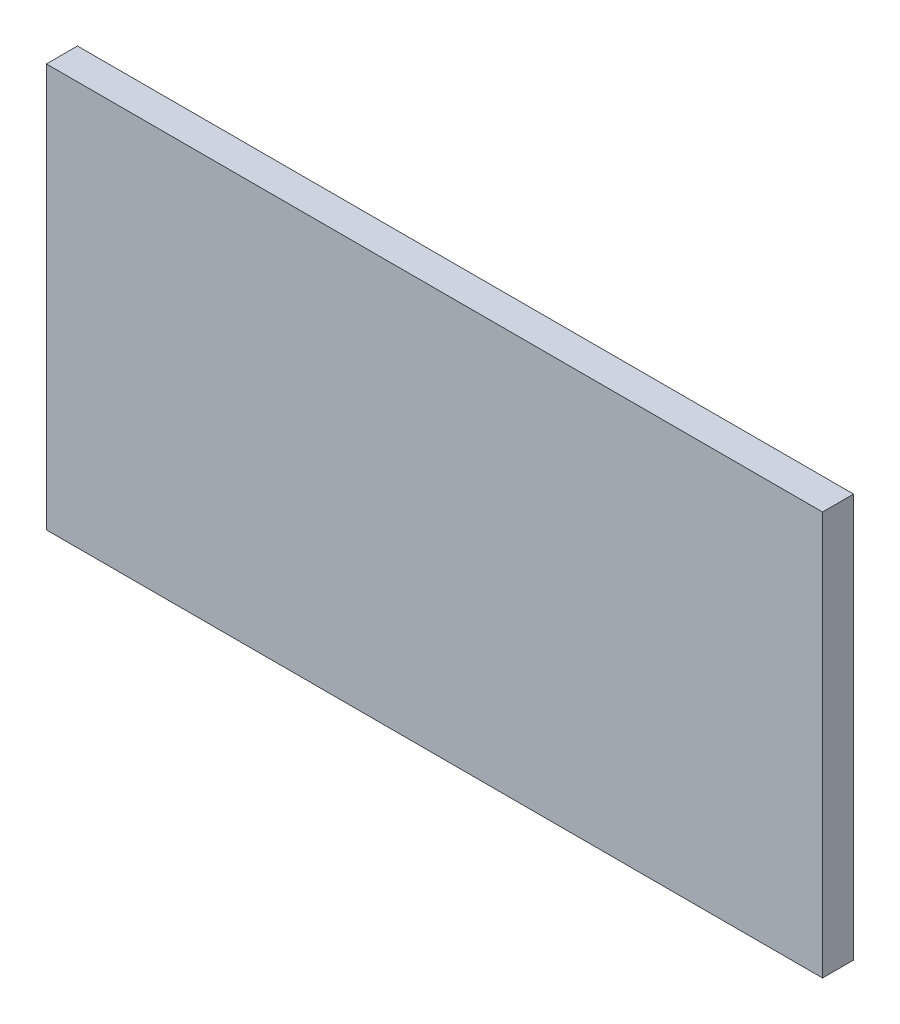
from build123d import *

# Parameters (mm, degrees)
SKETCH1_W           = 2540
SKETCH1_H           = 1320.8
BOSS_EXTRUDE1_DEPTH = 101.6


with BuildPart() as part:
    # Sketch1 → Boss-Extrude1 (new body)
    with BuildSketch(Plane.XY):
        with Locations((1270, 660.4)):
            Rectangle(SKETCH1_W, SKETCH1_H)
    extrude(amount=BOSS_EXTRUDE1_DEPTH)


solid = part.part
